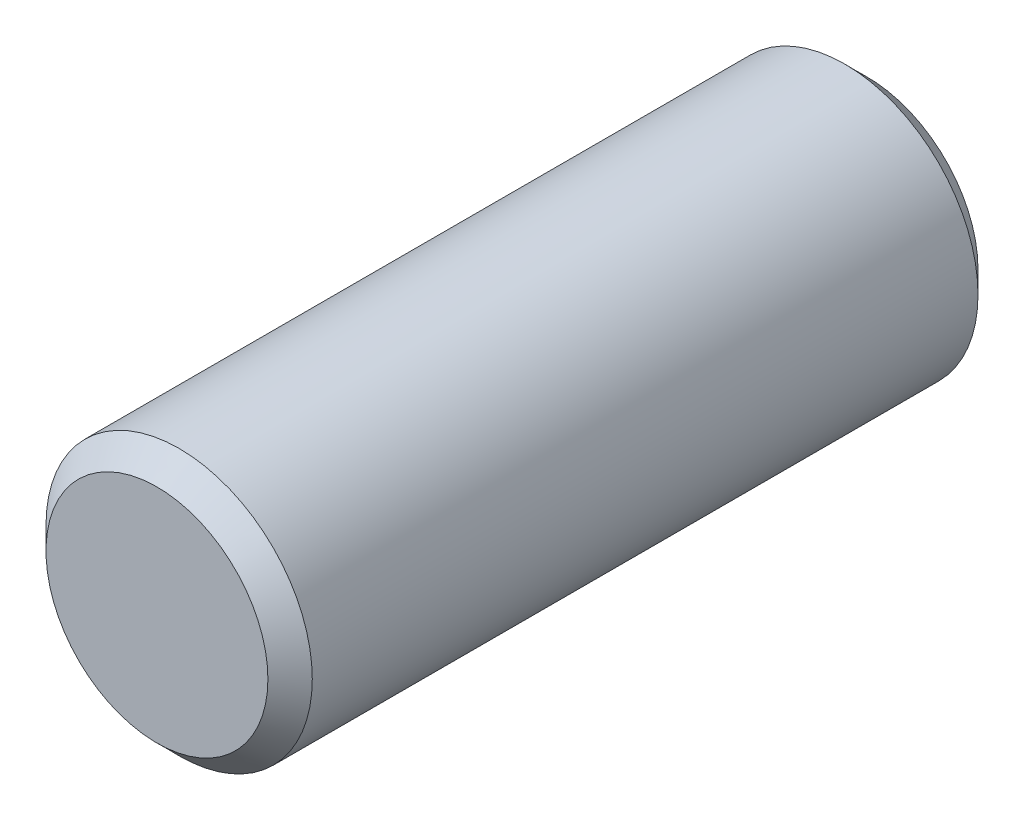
ISO-10303-21;
HEADER;
FILE_DESCRIPTION(('STEP AP214'),'2;1');
FILE_NAME('part.step','',(''),(''),'','','');
FILE_SCHEMA(('AUTOMOTIVE_DESIGN { 1 0 10303 214 1 1 1 1 }'));
ENDSEC;
DATA;
#1=APPLICATION_CONTEXT('core data for automotive mechanical design processes');
#2=APPLICATION_PROTOCOL_DEFINITION('international standard','automotive_design',2000,#1);
#3=PRODUCT_CONTEXT('',#1,'mechanical');
#4=PRODUCT('Part','Part','',(#3));
#5=PRODUCT_RELATED_PRODUCT_CATEGORY('part','',(#4));
#6=PRODUCT_DEFINITION_FORMATION('','',#4);
#7=PRODUCT_DEFINITION_CONTEXT('part definition',#1,'design');
#8=PRODUCT_DEFINITION('design','',#6,#7);
#9=PRODUCT_DEFINITION_SHAPE('','',#8);
#10=(LENGTH_UNIT() NAMED_UNIT(*) SI_UNIT(.MILLI.,.METRE.));
#11=(NAMED_UNIT(*) PLANE_ANGLE_UNIT() SI_UNIT($,.RADIAN.));
#12=(NAMED_UNIT(*) SI_UNIT($,.STERADIAN.) SOLID_ANGLE_UNIT());
#13=UNCERTAINTY_MEASURE_WITH_UNIT(LENGTH_MEASURE(1.E-05),#10,'distance_accuracy_value','');
#14=(GEOMETRIC_REPRESENTATION_CONTEXT(3) GLOBAL_UNCERTAINTY_ASSIGNED_CONTEXT((#13)) GLOBAL_UNIT_ASSIGNED_CONTEXT((#10,
#11,#12)) REPRESENTATION_CONTEXT('',''));
#15=CARTESIAN_POINT('',(0.,0.,0.));
#16=DIRECTION('',(0.,0.,1.));
#17=DIRECTION('',(1.,0.,0.));
#18=AXIS2_PLACEMENT_3D('',#15,#16,#17);
#19=CARTESIAN_POINT('',(0.,0.,16.));
#20=DIRECTION('',(0.,0.,-1.));
#21=DIRECTION('',(-1.,0.,0.));
#22=AXIS2_PLACEMENT_3D('',#19,#20,#21);
#23=CYLINDRICAL_SURFACE('',#22,3.);
#24=CARTESIAN_POINT('',(0.,0.,15.5));
#25=DIRECTION('',(0.,0.,1.));
#26=DIRECTION('',(1.,0.,0.));
#27=AXIS2_PLACEMENT_3D('',#24,#25,#26);
#28=CIRCLE('',#27,3.);
#29=CARTESIAN_POINT('',(3.,0.,15.5));
#30=VERTEX_POINT('',#29);
#31=EDGE_CURVE('E39',#30,#30,#28,.F.);
#32=ORIENTED_EDGE('',*,*,#31,.T.);
#33=EDGE_LOOP('',(#32));
#34=FACE_BOUND('',#33,.T.);
#35=CARTESIAN_POINT('',(0.,0.,0.5));
#36=DIRECTION('',(0.,0.,1.));
#37=DIRECTION('',(1.,0.,0.));
#38=AXIS2_PLACEMENT_3D('',#35,#36,#37);
#39=CIRCLE('',#38,3.);
#40=CARTESIAN_POINT('',(3.,0.,0.5));
#41=VERTEX_POINT('',#40);
#42=EDGE_CURVE('E142',#41,#41,#39,.T.);
#43=ORIENTED_EDGE('',*,*,#42,.T.);
#44=EDGE_LOOP('',(#43));
#45=FACE_BOUND('',#44,.T.);
#46=ADVANCED_FACE('F32',(#34,#45),#23,.T.);
#47=CARTESIAN_POINT('',(0.,0.,16.));
#48=DIRECTION('',(0.,0.,1.));
#49=DIRECTION('',(1.,0.,0.));
#50=AXIS2_PLACEMENT_3D('',#47,#48,#49);
#51=PLANE('',#50);
#52=CARTESIAN_POINT('',(0.,0.,16.));
#53=DIRECTION('',(0.,0.,1.));
#54=DIRECTION('',(1.,0.,0.));
#55=AXIS2_PLACEMENT_3D('',#52,#53,#54);
#56=CIRCLE('',#55,2.5);
#57=CARTESIAN_POINT('',(2.5,0.,16.));
#58=VERTEX_POINT('',#57);
#59=EDGE_CURVE('E133',#58,#58,#56,.T.);
#60=ORIENTED_EDGE('',*,*,#59,.T.);
#61=EDGE_LOOP('',(#60));
#62=FACE_BOUND('',#61,.T.);
#63=ADVANCED_FACE('F157',(#62),#51,.T.);
#64=CARTESIAN_POINT('',(0.,0.,0.));
#65=DIRECTION('',(0.,0.,1.));
#66=DIRECTION('',(1.,0.,0.));
#67=AXIS2_PLACEMENT_3D('',#64,#65,#66);
#68=PLANE('',#67);
#69=CARTESIAN_POINT('',(0.,0.,0.));
#70=DIRECTION('',(0.,0.,1.));
#71=DIRECTION('',(1.,0.,0.));
#72=AXIS2_PLACEMENT_3D('',#69,#70,#71);
#73=CIRCLE('',#72,2.5);
#74=CARTESIAN_POINT('',(2.5,0.,0.));
#75=VERTEX_POINT('',#74);
#76=EDGE_CURVE('E11',#75,#75,#73,.F.);
#77=ORIENTED_EDGE('',*,*,#76,.T.);
#78=EDGE_LOOP('',(#77));
#79=FACE_BOUND('',#78,.T.);
#80=DIRECTION('',(-0.708008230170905,0.706204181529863,0.));
#81=VECTOR('',#80,1.);
#82=CARTESIAN_POINT('',(-0.446153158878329,-1.67360310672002,0.));
#83=LINE('',#82,#81);
#84=CARTESIAN_POINT('',(-0.446153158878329,-1.67360310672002,0.));
#85=VERTEX_POINT('',#84);
#86=CARTESIAN_POINT('',(-1.67245938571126,-0.450421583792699,0.));
#87=VERTEX_POINT('',#86);
#88=EDGE_CURVE('E100',#85,#87,#83,.T.);
#89=ORIENTED_EDGE('',*,*,#88,.F.);
#90=DIRECTION('',(-0.965594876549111,-0.260051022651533,0.));
#91=VECTOR('',#90,1.);
#92=CARTESIAN_POINT('',(1.22630622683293,-1.22318152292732,0.));
#93=LINE('',#92,#91);
#94=CARTESIAN_POINT('',(1.22630622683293,-1.22318152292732,0.));
#95=VERTEX_POINT('',#94);
#96=EDGE_CURVE('E46',#95,#85,#93,.T.);
#97=ORIENTED_EDGE('',*,*,#96,.F.);
#98=DIRECTION('',(-0.257586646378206,-0.966255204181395,0.));
#99=VECTOR('',#98,1.);
#100=CARTESIAN_POINT('',(1.67245938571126,0.450421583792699,0.));
#101=LINE('',#100,#99);
#102=CARTESIAN_POINT('',(1.67245938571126,0.450421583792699,0.));
#103=VERTEX_POINT('',#102);
#104=EDGE_CURVE('E115',#103,#95,#101,.T.);
#105=ORIENTED_EDGE('',*,*,#104,.F.);
#106=DIRECTION('',(0.708008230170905,-0.706204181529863,0.));
#107=VECTOR('',#106,1.);
#108=CARTESIAN_POINT('',(0.44615315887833,1.67360310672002,0.));
#109=LINE('',#108,#107);
#110=CARTESIAN_POINT('',(0.44615315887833,1.67360310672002,0.));
#111=VERTEX_POINT('',#110);
#112=EDGE_CURVE('E109',#111,#103,#109,.T.);
#113=ORIENTED_EDGE('',*,*,#112,.F.);
#114=DIRECTION('',(0.965594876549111,0.260051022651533,0.));
#115=VECTOR('',#114,1.);
#116=CARTESIAN_POINT('',(-1.22630622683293,1.22318152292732,0.));
#117=LINE('',#116,#115);
#118=CARTESIAN_POINT('',(-1.22630622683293,1.22318152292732,0.));
#119=VERTEX_POINT('',#118);
#120=EDGE_CURVE('E107',#119,#111,#117,.T.);
#121=ORIENTED_EDGE('',*,*,#120,.F.);
#122=DIRECTION('',(0.257586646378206,0.966255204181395,0.));
#123=VECTOR('',#122,1.);
#124=CARTESIAN_POINT('',(-1.67245938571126,-0.450421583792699,0.));
#125=LINE('',#124,#123);
#126=EDGE_CURVE('E89',#87,#119,#125,.T.);
#127=ORIENTED_EDGE('',*,*,#126,.F.);
#128=EDGE_LOOP('',(#89,#97,#105,#113,#121,#127));
#129=FACE_BOUND('',#128,.T.);
#130=ADVANCED_FACE('F104',(#79,#129),#68,.F.);
#131=CARTESIAN_POINT('',(1.22630622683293,-1.22318152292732,4.));
#132=DIRECTION('',(0.260051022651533,-0.96559487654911,0.));
#133=DIRECTION('',(0.965594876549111,0.260051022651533,0.));
#134=AXIS2_PLACEMENT_3D('',#131,#132,#133);
#135=PLANE('',#134);
#136=ORIENTED_EDGE('',*,*,#96,.T.);
#137=DIRECTION('',(0.,0.,-1.));
#138=VECTOR('',#137,1.);
#139=CARTESIAN_POINT('',(-0.446153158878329,-1.67360310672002,4.));
#140=LINE('',#139,#138);
#141=CARTESIAN_POINT('',(-0.446153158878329,-1.67360310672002,4.));
#142=VERTEX_POINT('',#141);
#143=EDGE_CURVE('E97',#142,#85,#140,.T.);
#144=ORIENTED_EDGE('',*,*,#143,.F.);
#145=DIRECTION('',(-0.965594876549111,-0.260051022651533,0.));
#146=VECTOR('',#145,1.);
#147=CARTESIAN_POINT('',(1.22630622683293,-1.22318152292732,4.));
#148=LINE('',#147,#146);
#149=CARTESIAN_POINT('',(1.22630622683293,-1.22318152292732,4.));
#150=VERTEX_POINT('',#149);
#151=EDGE_CURVE('E117',#150,#142,#148,.T.);
#152=ORIENTED_EDGE('',*,*,#151,.F.);
#153=DIRECTION('',(0.,0.,-1.));
#154=VECTOR('',#153,1.);
#155=CARTESIAN_POINT('',(1.22630622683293,-1.22318152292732,4.));
#156=LINE('',#155,#154);
#157=EDGE_CURVE('E53',#150,#95,#156,.T.);
#158=ORIENTED_EDGE('',*,*,#157,.T.);
#159=EDGE_LOOP('',(#136,#144,#152,#158));
#160=FACE_BOUND('',#159,.T.);
#161=ADVANCED_FACE('F163',(#160),#135,.F.);
#162=CARTESIAN_POINT('',(1.67245938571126,0.450421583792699,4.));
#163=DIRECTION('',(0.966255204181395,-0.257586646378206,0.));
#164=DIRECTION('',(0.257586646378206,0.966255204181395,0.));
#165=AXIS2_PLACEMENT_3D('',#162,#163,#164);
#166=PLANE('',#165);
#167=ORIENTED_EDGE('',*,*,#104,.T.);
#168=ORIENTED_EDGE('',*,*,#157,.F.);
#169=DIRECTION('',(-0.257586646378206,-0.966255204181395,0.));
#170=VECTOR('',#169,1.);
#171=CARTESIAN_POINT('',(1.67245938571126,0.450421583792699,4.));
#172=LINE('',#171,#170);
#173=CARTESIAN_POINT('',(1.67245938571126,0.450421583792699,4.));
#174=VERTEX_POINT('',#173);
#175=EDGE_CURVE('E129',#174,#150,#172,.T.);
#176=ORIENTED_EDGE('',*,*,#175,.F.);
#177=DIRECTION('',(0.,0.,-1.));
#178=VECTOR('',#177,1.);
#179=CARTESIAN_POINT('',(1.67245938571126,0.450421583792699,4.));
#180=LINE('',#179,#178);
#181=EDGE_CURVE('E134',#174,#103,#180,.T.);
#182=ORIENTED_EDGE('',*,*,#181,.T.);
#183=EDGE_LOOP('',(#167,#168,#176,#182));
#184=FACE_BOUND('',#183,.T.);
#185=ADVANCED_FACE('F169',(#184),#166,.F.);
#186=CARTESIAN_POINT('',(0.44615315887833,1.67360310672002,4.));
#187=DIRECTION('',(0.706204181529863,0.708008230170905,0.));
#188=DIRECTION('',(-0.708008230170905,0.706204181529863,0.));
#189=AXIS2_PLACEMENT_3D('',#186,#187,#188);
#190=PLANE('',#189);
#191=ORIENTED_EDGE('',*,*,#112,.T.);
#192=ORIENTED_EDGE('',*,*,#181,.F.);
#193=DIRECTION('',(0.708008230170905,-0.706204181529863,0.));
#194=VECTOR('',#193,1.);
#195=CARTESIAN_POINT('',(0.44615315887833,1.67360310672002,4.));
#196=LINE('',#195,#194);
#197=CARTESIAN_POINT('',(0.44615315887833,1.67360310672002,4.));
#198=VERTEX_POINT('',#197);
#199=EDGE_CURVE('E126',#198,#174,#196,.T.);
#200=ORIENTED_EDGE('',*,*,#199,.F.);
#201=DIRECTION('',(0.,0.,-1.));
#202=VECTOR('',#201,1.);
#203=CARTESIAN_POINT('',(0.44615315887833,1.67360310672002,4.));
#204=LINE('',#203,#202);
#205=EDGE_CURVE('E136',#198,#111,#204,.T.);
#206=ORIENTED_EDGE('',*,*,#205,.T.);
#207=EDGE_LOOP('',(#191,#192,#200,#206));
#208=FACE_BOUND('',#207,.T.);
#209=ADVANCED_FACE('F177',(#208),#190,.F.);
#210=CARTESIAN_POINT('',(-1.22630622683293,1.22318152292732,4.));
#211=DIRECTION('',(-0.260051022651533,0.965594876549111,0.));
#212=DIRECTION('',(-0.965594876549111,-0.260051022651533,0.));
#213=AXIS2_PLACEMENT_3D('',#210,#211,#212);
#214=PLANE('',#213);
#215=ORIENTED_EDGE('',*,*,#120,.T.);
#216=ORIENTED_EDGE('',*,*,#205,.F.);
#217=DIRECTION('',(0.965594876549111,0.260051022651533,0.));
#218=VECTOR('',#217,1.);
#219=CARTESIAN_POINT('',(-1.22630622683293,1.22318152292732,4.));
#220=LINE('',#219,#218);
#221=CARTESIAN_POINT('',(-1.22630622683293,1.22318152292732,4.));
#222=VERTEX_POINT('',#221);
#223=EDGE_CURVE('E123',#222,#198,#220,.T.);
#224=ORIENTED_EDGE('',*,*,#223,.F.);
#225=DIRECTION('',(0.,0.,-1.));
#226=VECTOR('',#225,1.);
#227=CARTESIAN_POINT('',(-1.22630622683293,1.22318152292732,4.));
#228=LINE('',#227,#226);
#229=EDGE_CURVE('E96',#222,#119,#228,.T.);
#230=ORIENTED_EDGE('',*,*,#229,.T.);
#231=EDGE_LOOP('',(#215,#216,#224,#230));
#232=FACE_BOUND('',#231,.T.);
#233=ADVANCED_FACE('F174',(#232),#214,.F.);
#234=CARTESIAN_POINT('',(-1.67245938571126,-0.450421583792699,4.));
#235=DIRECTION('',(-0.966255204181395,0.257586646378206,0.));
#236=DIRECTION('',(-0.257586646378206,-0.966255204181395,0.));
#237=AXIS2_PLACEMENT_3D('',#234,#235,#236);
#238=PLANE('',#237);
#239=ORIENTED_EDGE('',*,*,#126,.T.);
#240=ORIENTED_EDGE('',*,*,#229,.F.);
#241=DIRECTION('',(0.257586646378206,0.966255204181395,0.));
#242=VECTOR('',#241,1.);
#243=CARTESIAN_POINT('',(-1.67245938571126,-0.450421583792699,4.));
#244=LINE('',#243,#242);
#245=CARTESIAN_POINT('',(-1.67245938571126,-0.450421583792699,4.));
#246=VERTEX_POINT('',#245);
#247=EDGE_CURVE('E92',#246,#222,#244,.T.);
#248=ORIENTED_EDGE('',*,*,#247,.F.);
#249=DIRECTION('',(0.,0.,-1.));
#250=VECTOR('',#249,1.);
#251=CARTESIAN_POINT('',(-1.67245938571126,-0.450421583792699,4.));
#252=LINE('',#251,#250);
#253=EDGE_CURVE('E85',#246,#87,#252,.T.);
#254=ORIENTED_EDGE('',*,*,#253,.T.);
#255=EDGE_LOOP('',(#239,#240,#248,#254));
#256=FACE_BOUND('',#255,.T.);
#257=ADVANCED_FACE('F87',(#256),#238,.F.);
#258=CARTESIAN_POINT('',(-0.446153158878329,-1.67360310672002,4.));
#259=DIRECTION('',(-0.706204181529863,-0.708008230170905,0.));
#260=DIRECTION('',(0.708008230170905,-0.706204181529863,0.));
#261=AXIS2_PLACEMENT_3D('',#258,#259,#260);
#262=PLANE('',#261);
#263=ORIENTED_EDGE('',*,*,#88,.T.);
#264=ORIENTED_EDGE('',*,*,#253,.F.);
#265=DIRECTION('',(-0.708008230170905,0.706204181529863,0.));
#266=VECTOR('',#265,1.);
#267=CARTESIAN_POINT('',(-0.446153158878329,-1.67360310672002,4.));
#268=LINE('',#267,#266);
#269=EDGE_CURVE('E120',#142,#246,#268,.T.);
#270=ORIENTED_EDGE('',*,*,#269,.F.);
#271=ORIENTED_EDGE('',*,*,#143,.T.);
#272=EDGE_LOOP('',(#263,#264,#270,#271));
#273=FACE_BOUND('',#272,.T.);
#274=ADVANCED_FACE('F101',(#273),#262,.F.);
#275=CARTESIAN_POINT('',(-0.446153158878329,-1.67360310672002,4.));
#276=DIRECTION('',(0.,0.,-1.));
#277=DIRECTION('',(-1.,0.,0.));
#278=AXIS2_PLACEMENT_3D('',#275,#276,#277);
#279=PLANE('',#278);
#280=ORIENTED_EDGE('',*,*,#151,.T.);
#281=ORIENTED_EDGE('',*,*,#269,.T.);
#282=ORIENTED_EDGE('',*,*,#247,.T.);
#283=ORIENTED_EDGE('',*,*,#223,.T.);
#284=ORIENTED_EDGE('',*,*,#199,.T.);
#285=ORIENTED_EDGE('',*,*,#175,.T.);
#286=EDGE_LOOP('',(#280,#281,#282,#283,#284,#285));
#287=FACE_BOUND('',#286,.T.);
#288=ADVANCED_FACE('F153',(#287),#279,.T.);
#289=CARTESIAN_POINT('',(0.,0.,16.));
#290=DIRECTION('',(0.,0.,-1.));
#291=DIRECTION('',(-1.,0.,0.));
#292=AXIS2_PLACEMENT_3D('',#289,#290,#291);
#293=CONICAL_SURFACE('',#292,2.5,0.785398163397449);
#294=ORIENTED_EDGE('',*,*,#31,.F.);
#295=EDGE_LOOP('',(#294));
#296=FACE_BOUND('',#295,.T.);
#297=ORIENTED_EDGE('',*,*,#59,.F.);
#298=EDGE_LOOP('',(#297));
#299=FACE_BOUND('',#298,.T.);
#300=ADVANCED_FACE('F149',(#296,#299),#293,.T.);
#301=CARTESIAN_POINT('',(0.,0.,0.5));
#302=DIRECTION('',(0.,0.,1.));
#303=DIRECTION('',(1.,0.,0.));
#304=AXIS2_PLACEMENT_3D('',#301,#302,#303);
#305=CONICAL_SURFACE('',#304,3.,0.785398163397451);
#306=ORIENTED_EDGE('',*,*,#76,.F.);
#307=EDGE_LOOP('',(#306));
#308=FACE_BOUND('',#307,.T.);
#309=ORIENTED_EDGE('',*,*,#42,.F.);
#310=EDGE_LOOP('',(#309));
#311=FACE_BOUND('',#310,.T.);
#312=ADVANCED_FACE('F152',(#308,#311),#305,.T.);
#313=CLOSED_SHELL('',(#46,#63,#130,#161,#185,#209,#233,#257,#274,#288,#300,#312));
#314=MANIFOLD_SOLID_BREP('B2',#313);
#315=ADVANCED_BREP_SHAPE_REPRESENTATION('',(#18,#314),#14);
#316=SHAPE_DEFINITION_REPRESENTATION(#9,#315);
ENDSEC;
END-ISO-10303-21;
